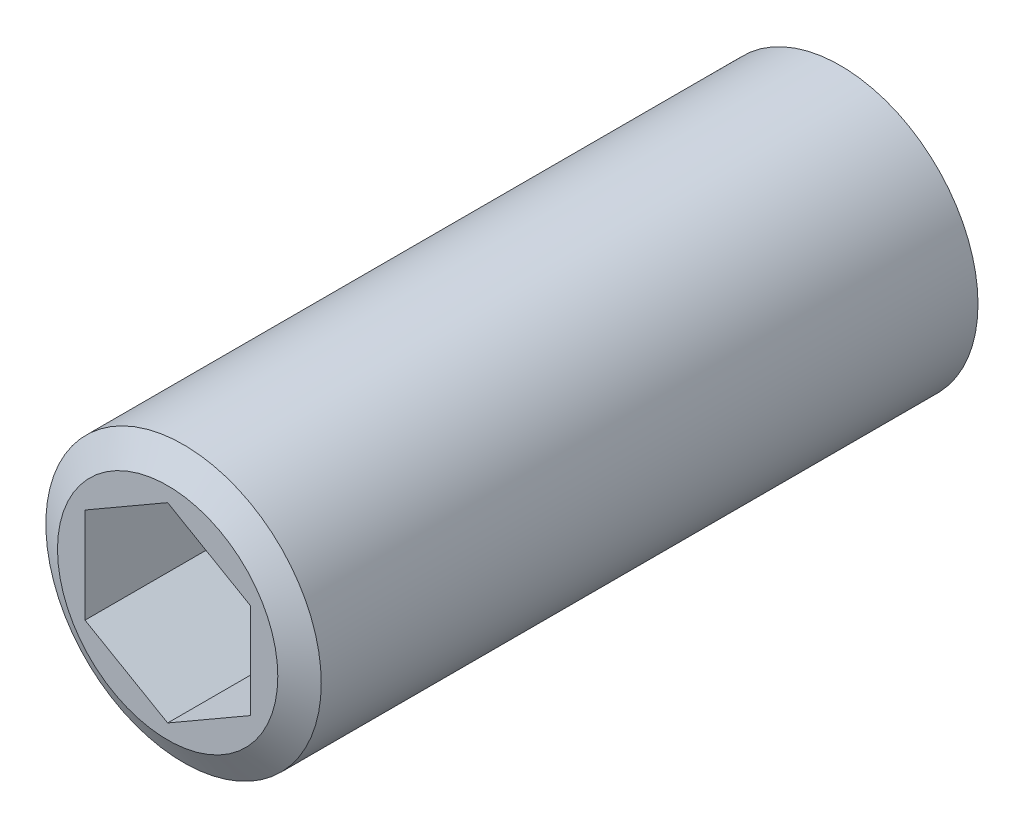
ISO-10303-21;
HEADER;
FILE_DESCRIPTION(('STEP AP214'),'2;1');
FILE_NAME('part.step','',(''),(''),'','','');
FILE_SCHEMA(('AUTOMOTIVE_DESIGN { 1 0 10303 214 1 1 1 1 }'));
ENDSEC;
DATA;
#1=APPLICATION_CONTEXT('core data for automotive mechanical design processes');
#2=APPLICATION_PROTOCOL_DEFINITION('international standard','automotive_design',2000,#1);
#3=PRODUCT_CONTEXT('',#1,'mechanical');
#4=PRODUCT('Part','Part','',(#3));
#5=PRODUCT_RELATED_PRODUCT_CATEGORY('part','',(#4));
#6=PRODUCT_DEFINITION_FORMATION('','',#4);
#7=PRODUCT_DEFINITION_CONTEXT('part definition',#1,'design');
#8=PRODUCT_DEFINITION('design','',#6,#7);
#9=PRODUCT_DEFINITION_SHAPE('','',#8);
#10=(LENGTH_UNIT() NAMED_UNIT(*) SI_UNIT(.MILLI.,.METRE.));
#11=(NAMED_UNIT(*) PLANE_ANGLE_UNIT() SI_UNIT($,.RADIAN.));
#12=(NAMED_UNIT(*) SI_UNIT($,.STERADIAN.) SOLID_ANGLE_UNIT());
#13=UNCERTAINTY_MEASURE_WITH_UNIT(LENGTH_MEASURE(1.E-05),#10,'distance_accuracy_value','');
#14=(GEOMETRIC_REPRESENTATION_CONTEXT(3) GLOBAL_UNCERTAINTY_ASSIGNED_CONTEXT((#13)) GLOBAL_UNIT_ASSIGNED_CONTEXT((#10,
#11,#12)) REPRESENTATION_CONTEXT('',''));
#15=CARTESIAN_POINT('',(0.,0.,0.));
#16=DIRECTION('',(0.,0.,1.));
#17=DIRECTION('',(1.,0.,0.));
#18=AXIS2_PLACEMENT_3D('',#15,#16,#17);
#19=CARTESIAN_POINT('',(5.,0.,1.27));
#20=DIRECTION('',(0.,0.,-1.));
#21=DIRECTION('',(-1.,0.,0.));
#22=AXIS2_PLACEMENT_3D('',#19,#20,#21);
#23=PLANE('',#22);
#24=CARTESIAN_POINT('',(0.,0.,1.27));
#25=DIRECTION('',(0.,0.,-1.));
#26=DIRECTION('',(-1.,0.,0.));
#27=AXIS2_PLACEMENT_3D('',#24,#25,#26);
#28=CIRCLE('',#27,4.);
#29=CARTESIAN_POINT('',(-4.,0.,1.27));
#30=VERTEX_POINT('',#29);
#31=EDGE_CURVE('E9',#30,#30,#28,.T.);
#32=ORIENTED_EDGE('',*,*,#31,.T.);
#33=EDGE_LOOP('',(#32));
#34=FACE_BOUND('',#33,.T.);
#35=CARTESIAN_POINT('',(0.,0.,1.27));
#36=DIRECTION('',(0.,0.,-1.));
#37=DIRECTION('',(-1.,0.,0.));
#38=AXIS2_PLACEMENT_3D('',#35,#36,#37);
#39=CIRCLE('',#38,3.95);
#40=CARTESIAN_POINT('',(-3.95,0.,1.27));
#41=VERTEX_POINT('',#40);
#42=EDGE_CURVE('E686',#41,#41,#39,.T.);
#43=ORIENTED_EDGE('',*,*,#42,.F.);
#44=EDGE_LOOP('',(#43));
#45=FACE_BOUND('',#44,.T.);
#46=ADVANCED_FACE('F15',(#34,#45),#23,.T.);
#47=CARTESIAN_POINT('',(0.,0.,46.27));
#48=DIRECTION('',(0.,0.,1.));
#49=DIRECTION('',(1.,0.,0.));
#50=AXIS2_PLACEMENT_3D('',#47,#48,#49);
#51=CYLINDRICAL_SURFACE('',#50,5.);
#52=CARTESIAN_POINT('',(0.,0.,25.6926497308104));
#53=DIRECTION('',(0.,0.,1.));
#54=DIRECTION('',(1.,0.,0.));
#55=AXIS2_PLACEMENT_3D('',#52,#53,#54);
#56=CIRCLE('',#55,5.);
#57=CARTESIAN_POINT('',(5.,0.,25.6926497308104));
#58=VERTEX_POINT('',#57);
#59=EDGE_CURVE('E24',#58,#58,#56,.F.);
#60=ORIENTED_EDGE('',*,*,#59,.T.);
#61=EDGE_LOOP('',(#60));
#62=FACE_BOUND('',#61,.T.);
#63=CARTESIAN_POINT('',(0.,0.,1.8473502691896));
#64=DIRECTION('',(0.,0.,-1.));
#65=DIRECTION('',(-1.,0.,0.));
#66=AXIS2_PLACEMENT_3D('',#63,#64,#65);
#67=CIRCLE('',#66,5.);
#68=CARTESIAN_POINT('',(-5.,0.,1.8473502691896));
#69=VERTEX_POINT('',#68);
#70=EDGE_CURVE('E168',#69,#69,#67,.F.);
#71=ORIENTED_EDGE('',*,*,#70,.T.);
#72=EDGE_LOOP('',(#71));
#73=FACE_BOUND('',#72,.T.);
#74=ADVANCED_FACE('F180',(#62,#73),#51,.T.);
#75=CARTESIAN_POINT('',(0.,0.,26.27));
#76=DIRECTION('',(0.,0.,1.));
#77=DIRECTION('',(1.,0.,0.));
#78=AXIS2_PLACEMENT_3D('',#75,#76,#77);
#79=PLANE('',#78);
#80=CARTESIAN_POINT('',(0.,0.,26.27));
#81=DIRECTION('',(0.,0.,1.));
#82=DIRECTION('',(1.,0.,0.));
#83=AXIS2_PLACEMENT_3D('',#80,#81,#82);
#84=CIRCLE('',#83,4.);
#85=CARTESIAN_POINT('',(4.,0.,26.27));
#86=VERTEX_POINT('',#85);
#87=EDGE_CURVE('E161',#86,#86,#84,.T.);
#88=ORIENTED_EDGE('',*,*,#87,.T.);
#89=EDGE_LOOP('',(#88));
#90=FACE_BOUND('',#89,.T.);
#91=DIRECTION('',(0.86602540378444,-0.5,0.));
#92=VECTOR('',#91,1.);
#93=CARTESIAN_POINT('',(-3.,-1.73205080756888,26.27));
#94=LINE('',#93,#92);
#95=CARTESIAN_POINT('',(-3.,-1.73205080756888,26.27));
#96=VERTEX_POINT('',#95);
#97=CARTESIAN_POINT('',(0.,-3.46410161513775,26.27));
#98=VERTEX_POINT('',#97);
#99=EDGE_CURVE('E197',#96,#98,#94,.T.);
#100=ORIENTED_EDGE('',*,*,#99,.F.);
#101=DIRECTION('',(0.,-1.,0.));
#102=VECTOR('',#101,1.);
#103=CARTESIAN_POINT('',(-3.,1.73205080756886,26.27));
#104=LINE('',#103,#102);
#105=CARTESIAN_POINT('',(-3.,1.73205080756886,26.27));
#106=VERTEX_POINT('',#105);
#107=EDGE_CURVE('E200',#106,#96,#104,.T.);
#108=ORIENTED_EDGE('',*,*,#107,.F.);
#109=DIRECTION('',(0.866025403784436,0.5,0.));
#110=VECTOR('',#109,1.);
#111=CARTESIAN_POINT('',(-3.,1.73205080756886,26.27));
#112=LINE('',#111,#110);
#113=CARTESIAN_POINT('',(0.,3.46410161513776,26.27));
#114=VERTEX_POINT('',#113);
#115=EDGE_CURVE('E226',#106,#114,#112,.T.);
#116=ORIENTED_EDGE('',*,*,#115,.T.);
#117=DIRECTION('',(-0.866025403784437,0.5,0.));
#118=VECTOR('',#117,1.);
#119=CARTESIAN_POINT('',(3.,1.73205080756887,26.27));
#120=LINE('',#119,#118);
#121=CARTESIAN_POINT('',(3.,1.73205080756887,26.27));
#122=VERTEX_POINT('',#121);
#123=EDGE_CURVE('E222',#122,#114,#120,.T.);
#124=ORIENTED_EDGE('',*,*,#123,.F.);
#125=DIRECTION('',(0.,-1.,0.));
#126=VECTOR('',#125,1.);
#127=CARTESIAN_POINT('',(3.,1.73205080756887,26.27));
#128=LINE('',#127,#126);
#129=CARTESIAN_POINT('',(3.,-1.73205080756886,26.27));
#130=VERTEX_POINT('',#129);
#131=EDGE_CURVE('E211',#122,#130,#128,.T.);
#132=ORIENTED_EDGE('',*,*,#131,.T.);
#133=DIRECTION('',(-0.866025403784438,-0.5,0.));
#134=VECTOR('',#133,1.);
#135=CARTESIAN_POINT('',(3.,-1.73205080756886,26.27));
#136=LINE('',#135,#134);
#137=EDGE_CURVE('E203',#130,#98,#136,.T.);
#138=ORIENTED_EDGE('',*,*,#137,.T.);
#139=EDGE_LOOP('',(#100,#108,#116,#124,#132,#138));
#140=FACE_BOUND('',#139,.T.);
#141=ADVANCED_FACE('F189',(#90,#140),#79,.T.);
#142=CARTESIAN_POINT('',(-3.,-1.73205080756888,21.27));
#143=DIRECTION('',(-0.5,-0.86602540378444,0.));
#144=DIRECTION('',(-0.86602540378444,0.5,0.));
#145=AXIS2_PLACEMENT_3D('',#142,#143,#144);
#146=PLANE('',#145);
#147=DIRECTION('',(0.,0.,1.));
#148=VECTOR('',#147,1.);
#149=CARTESIAN_POINT('',(-3.,-1.73205080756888,21.27));
#150=LINE('',#149,#148);
#151=CARTESIAN_POINT('',(-3.,-1.73205080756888,21.27));
#152=VERTEX_POINT('',#151);
#153=EDGE_CURVE('E162',#152,#96,#150,.T.);
#154=ORIENTED_EDGE('',*,*,#153,.T.);
#155=ORIENTED_EDGE('',*,*,#99,.T.);
#156=DIRECTION('',(0.,0.,1.));
#157=VECTOR('',#156,1.);
#158=CARTESIAN_POINT('',(0.,-3.46410161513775,21.27));
#159=LINE('',#158,#157);
#160=CARTESIAN_POINT('',(0.,-3.46410161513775,21.27));
#161=VERTEX_POINT('',#160);
#162=EDGE_CURVE('E255',#161,#98,#159,.T.);
#163=ORIENTED_EDGE('',*,*,#162,.F.);
#164=DIRECTION('',(0.86602540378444,-0.5,0.));
#165=VECTOR('',#164,1.);
#166=CARTESIAN_POINT('',(-3.,-1.73205080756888,21.27));
#167=LINE('',#166,#165);
#168=EDGE_CURVE('E231',#152,#161,#167,.T.);
#169=ORIENTED_EDGE('',*,*,#168,.F.);
#170=EDGE_LOOP('',(#154,#155,#163,#169));
#171=FACE_BOUND('',#170,.T.);
#172=ADVANCED_FACE('F192',(#171),#146,.F.);
#173=CARTESIAN_POINT('',(-3.,1.73205080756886,21.27));
#174=DIRECTION('',(-1.,0.,0.));
#175=DIRECTION('',(0.,1.,0.));
#176=AXIS2_PLACEMENT_3D('',#173,#174,#175);
#177=PLANE('',#176);
#178=DIRECTION('',(0.,0.,1.));
#179=VECTOR('',#178,1.);
#180=CARTESIAN_POINT('',(-3.,1.73205080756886,21.27));
#181=LINE('',#180,#179);
#182=CARTESIAN_POINT('',(-3.,1.73205080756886,21.27));
#183=VERTEX_POINT('',#182);
#184=EDGE_CURVE('E170',#183,#106,#181,.T.);
#185=ORIENTED_EDGE('',*,*,#184,.T.);
#186=ORIENTED_EDGE('',*,*,#107,.T.);
#187=ORIENTED_EDGE('',*,*,#153,.F.);
#188=DIRECTION('',(0.,-1.,0.));
#189=VECTOR('',#188,1.);
#190=CARTESIAN_POINT('',(-3.,1.73205080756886,21.27));
#191=LINE('',#190,#189);
#192=EDGE_CURVE('E251',#183,#152,#191,.T.);
#193=ORIENTED_EDGE('',*,*,#192,.F.);
#194=EDGE_LOOP('',(#185,#186,#187,#193));
#195=FACE_BOUND('',#194,.T.);
#196=ADVANCED_FACE('F270',(#195),#177,.F.);
#197=CARTESIAN_POINT('',(-3.,1.73205080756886,21.27));
#198=DIRECTION('',(0.5,-0.866025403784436,0.));
#199=DIRECTION('',(-0.866025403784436,-0.5,0.));
#200=AXIS2_PLACEMENT_3D('',#197,#198,#199);
#201=PLANE('',#200);
#202=DIRECTION('',(0.,0.,1.));
#203=VECTOR('',#202,1.);
#204=CARTESIAN_POINT('',(0.,3.46410161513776,21.27));
#205=LINE('',#204,#203);
#206=CARTESIAN_POINT('',(0.,3.46410161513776,21.27));
#207=VERTEX_POINT('',#206);
#208=EDGE_CURVE('E264',#207,#114,#205,.T.);
#209=ORIENTED_EDGE('',*,*,#208,.T.);
#210=ORIENTED_EDGE('',*,*,#115,.F.);
#211=ORIENTED_EDGE('',*,*,#184,.F.);
#212=DIRECTION('',(0.866025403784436,0.5,0.));
#213=VECTOR('',#212,1.);
#214=CARTESIAN_POINT('',(-3.,1.73205080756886,21.27));
#215=LINE('',#214,#213);
#216=EDGE_CURVE('E247',#183,#207,#215,.T.);
#217=ORIENTED_EDGE('',*,*,#216,.T.);
#218=EDGE_LOOP('',(#209,#210,#211,#217));
#219=FACE_BOUND('',#218,.T.);
#220=ADVANCED_FACE('F273',(#219),#201,.T.);
#221=CARTESIAN_POINT('',(3.,1.73205080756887,21.27));
#222=DIRECTION('',(0.5,0.866025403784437,0.));
#223=DIRECTION('',(0.866025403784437,-0.5,0.));
#224=AXIS2_PLACEMENT_3D('',#221,#222,#223);
#225=PLANE('',#224);
#226=DIRECTION('',(0.,0.,1.));
#227=VECTOR('',#226,1.);
#228=CARTESIAN_POINT('',(3.,1.73205080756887,21.27));
#229=LINE('',#228,#227);
#230=CARTESIAN_POINT('',(3.,1.73205080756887,21.27));
#231=VERTEX_POINT('',#230);
#232=EDGE_CURVE('E261',#231,#122,#229,.T.);
#233=ORIENTED_EDGE('',*,*,#232,.T.);
#234=ORIENTED_EDGE('',*,*,#123,.T.);
#235=ORIENTED_EDGE('',*,*,#208,.F.);
#236=DIRECTION('',(-0.866025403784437,0.5,0.));
#237=VECTOR('',#236,1.);
#238=CARTESIAN_POINT('',(3.,1.73205080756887,21.27));
#239=LINE('',#238,#237);
#240=EDGE_CURVE('E243',#231,#207,#239,.T.);
#241=ORIENTED_EDGE('',*,*,#240,.F.);
#242=EDGE_LOOP('',(#233,#234,#235,#241));
#243=FACE_BOUND('',#242,.T.);
#244=ADVANCED_FACE('F277',(#243),#225,.F.);
#245=CARTESIAN_POINT('',(3.,1.73205080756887,21.27));
#246=DIRECTION('',(-1.,0.,0.));
#247=DIRECTION('',(0.,1.,0.));
#248=AXIS2_PLACEMENT_3D('',#245,#246,#247);
#249=PLANE('',#248);
#250=DIRECTION('',(0.,0.,1.));
#251=VECTOR('',#250,1.);
#252=CARTESIAN_POINT('',(3.,-1.73205080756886,21.27));
#253=LINE('',#252,#251);
#254=CARTESIAN_POINT('',(3.,-1.73205080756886,21.27));
#255=VERTEX_POINT('',#254);
#256=EDGE_CURVE('E258',#255,#130,#253,.T.);
#257=ORIENTED_EDGE('',*,*,#256,.T.);
#258=ORIENTED_EDGE('',*,*,#131,.F.);
#259=ORIENTED_EDGE('',*,*,#232,.F.);
#260=DIRECTION('',(0.,-1.,0.));
#261=VECTOR('',#260,1.);
#262=CARTESIAN_POINT('',(3.,1.73205080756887,21.27));
#263=LINE('',#262,#261);
#264=EDGE_CURVE('E239',#231,#255,#263,.T.);
#265=ORIENTED_EDGE('',*,*,#264,.T.);
#266=EDGE_LOOP('',(#257,#258,#259,#265));
#267=FACE_BOUND('',#266,.T.);
#268=ADVANCED_FACE('F281',(#267),#249,.T.);
#269=CARTESIAN_POINT('',(3.,-1.73205080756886,21.27));
#270=DIRECTION('',(-0.5,0.866025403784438,0.));
#271=DIRECTION('',(0.866025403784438,0.5,0.));
#272=AXIS2_PLACEMENT_3D('',#269,#270,#271);
#273=PLANE('',#272);
#274=DIRECTION('',(-0.866025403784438,-0.5,0.));
#275=VECTOR('',#274,1.);
#276=CARTESIAN_POINT('',(3.,-1.73205080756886,21.27));
#277=LINE('',#276,#275);
#278=EDGE_CURVE('E235',#255,#161,#277,.T.);
#279=ORIENTED_EDGE('',*,*,#278,.T.);
#280=ORIENTED_EDGE('',*,*,#162,.T.);
#281=ORIENTED_EDGE('',*,*,#137,.F.);
#282=ORIENTED_EDGE('',*,*,#256,.F.);
#283=EDGE_LOOP('',(#279,#280,#281,#282));
#284=FACE_BOUND('',#283,.T.);
#285=ADVANCED_FACE('F284',(#284),#273,.T.);
#286=CARTESIAN_POINT('',(-6.,0.,21.27));
#287=DIRECTION('',(0.,0.,1.));
#288=DIRECTION('',(1.,0.,0.));
#289=AXIS2_PLACEMENT_3D('',#286,#287,#288);
#290=PLANE('',#289);
#291=ORIENTED_EDGE('',*,*,#168,.T.);
#292=ORIENTED_EDGE('',*,*,#278,.F.);
#293=ORIENTED_EDGE('',*,*,#264,.F.);
#294=ORIENTED_EDGE('',*,*,#240,.T.);
#295=ORIENTED_EDGE('',*,*,#216,.F.);
#296=ORIENTED_EDGE('',*,*,#192,.T.);
#297=EDGE_LOOP('',(#291,#292,#293,#294,#295,#296));
#298=FACE_BOUND('',#297,.T.);
#299=ADVANCED_FACE('F287',(#298),#290,.T.);
#300=CARTESIAN_POINT('',(0.,0.,9.17));
#301=DIRECTION('',(0.,0.,-1.));
#302=DIRECTION('',(-1.,0.,0.));
#303=AXIS2_PLACEMENT_3D('',#300,#301,#302);
#304=CYLINDRICAL_SURFACE('',#303,3.95);
#305=ORIENTED_EDGE('',*,*,#42,.T.);
#306=EDGE_LOOP('',(#305));
#307=FACE_BOUND('',#306,.T.);
#308=CARTESIAN_POINT('',(0.,0.,1.5));
#309=DIRECTION('',(0.,0.,1.));
#310=DIRECTION('',(1.,0.,0.));
#311=AXIS2_PLACEMENT_3D('',#308,#309,#310);
#312=CIRCLE('',#311,3.95);
#313=CARTESIAN_POINT('',(-2.56953303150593,-3.,1.5));
#314=VERTEX_POINT('',#313);
#315=CARTESIAN_POINT('',(2.56953303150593,-3.,1.5));
#316=VERTEX_POINT('',#315);
#317=EDGE_CURVE('E156',#314,#316,#312,.T.);
#318=ORIENTED_EDGE('',*,*,#317,.T.);
#319=CARTESIAN_POINT('',(0.,0.,-1.5));
#320=DIRECTION('',(0.,0.707106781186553,0.707106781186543));
#321=DIRECTION('',(0.,0.707106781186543,-0.707106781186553));
#322=AXIS2_PLACEMENT_3D('',#319,#320,#321);
#323=ELLIPSE('',#322,5.58614357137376,3.95);
#324=CARTESIAN_POINT('',(2.79307178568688,-2.79307178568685,1.29307178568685));
#325=VERTEX_POINT('',#324);
#326=EDGE_CURVE('E138',#316,#325,#323,.T.);
#327=ORIENTED_EDGE('',*,*,#326,.T.);
#328=CARTESIAN_POINT('',(0.,0.,-1.5));
#329=DIRECTION('',(-0.707106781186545,0.,0.70710678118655));
#330=DIRECTION('',(-0.70710678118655,0.,-0.707106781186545));
#331=AXIS2_PLACEMENT_3D('',#328,#329,#330);
#332=ELLIPSE('',#331,5.58614357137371,3.95);
#333=CARTESIAN_POINT('',(3.,-2.56953303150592,1.5));
#334=VERTEX_POINT('',#333);
#335=EDGE_CURVE('E150',#325,#334,#332,.T.);
#336=ORIENTED_EDGE('',*,*,#335,.T.);
#337=CARTESIAN_POINT('',(3.,2.56953303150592,1.5));
#338=VERTEX_POINT('',#337);
#339=EDGE_CURVE('E573',#334,#338,#312,.T.);
#340=ORIENTED_EDGE('',*,*,#339,.T.);
#341=CARTESIAN_POINT('',(0.,0.,-1.5));
#342=DIRECTION('',(-0.707106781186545,0.,0.70710678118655));
#343=DIRECTION('',(-0.70710678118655,0.,-0.707106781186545));
#344=AXIS2_PLACEMENT_3D('',#341,#342,#343);
#345=ELLIPSE('',#344,5.58614357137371,3.95);
#346=CARTESIAN_POINT('',(2.79307178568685,2.79307178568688,1.29307178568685));
#347=VERTEX_POINT('',#346);
#348=EDGE_CURVE('E564',#338,#347,#345,.T.);
#349=ORIENTED_EDGE('',*,*,#348,.T.);
#350=CARTESIAN_POINT('',(0.,0.,-1.5));
#351=DIRECTION('',(0.,-0.70710678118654,0.707106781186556));
#352=DIRECTION('',(0.,-0.707106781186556,-0.707106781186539));
#353=AXIS2_PLACEMENT_3D('',#350,#351,#352);
#354=ELLIPSE('',#353,5.58614357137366,3.95);
#355=CARTESIAN_POINT('',(2.56953303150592,3.,1.5));
#356=VERTEX_POINT('',#355);
#357=EDGE_CURVE('E571',#347,#356,#354,.T.);
#358=ORIENTED_EDGE('',*,*,#357,.T.);
#359=CARTESIAN_POINT('',(-2.56953303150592,3.,1.5));
#360=VERTEX_POINT('',#359);
#361=EDGE_CURVE('E649',#356,#360,#312,.T.);
#362=ORIENTED_EDGE('',*,*,#361,.T.);
#363=CARTESIAN_POINT('',(0.,0.,-1.5));
#364=DIRECTION('',(0.,-0.70710678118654,0.707106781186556));
#365=DIRECTION('',(0.,-0.707106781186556,-0.707106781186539));
#366=AXIS2_PLACEMENT_3D('',#363,#364,#365);
#367=ELLIPSE('',#366,5.58614357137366,3.95);
#368=CARTESIAN_POINT('',(-2.79307178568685,2.79307178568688,1.29307178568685));
#369=VERTEX_POINT('',#368);
#370=EDGE_CURVE('E654',#360,#369,#367,.T.);
#371=ORIENTED_EDGE('',*,*,#370,.T.);
#372=CARTESIAN_POINT('',(0.,0.,-1.5));
#373=DIRECTION('',(0.707106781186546,0.,0.70710678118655));
#374=DIRECTION('',(0.70710678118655,0.,-0.707106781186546));
#375=AXIS2_PLACEMENT_3D('',#372,#373,#374);
#376=ELLIPSE('',#375,5.58614357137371,3.95);
#377=CARTESIAN_POINT('',(-3.,2.56953303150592,1.5));
#378=VERTEX_POINT('',#377);
#379=EDGE_CURVE('E647',#369,#378,#376,.T.);
#380=ORIENTED_EDGE('',*,*,#379,.T.);
#381=CARTESIAN_POINT('',(-3.,-2.56953303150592,1.5));
#382=VERTEX_POINT('',#381);
#383=EDGE_CURVE('E38',#378,#382,#312,.T.);
#384=ORIENTED_EDGE('',*,*,#383,.T.);
#385=CARTESIAN_POINT('',(0.,0.,-1.5));
#386=DIRECTION('',(0.707106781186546,0.,0.70710678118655));
#387=DIRECTION('',(0.70710678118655,0.,-0.707106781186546));
#388=AXIS2_PLACEMENT_3D('',#385,#386,#387);
#389=ELLIPSE('',#388,5.58614357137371,3.95);
#390=CARTESIAN_POINT('',(-2.79307178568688,-2.79307178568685,1.29307178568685));
#391=VERTEX_POINT('',#390);
#392=EDGE_CURVE('E31',#382,#391,#389,.T.);
#393=ORIENTED_EDGE('',*,*,#392,.T.);
#394=CARTESIAN_POINT('',(0.,0.,-1.5));
#395=DIRECTION('',(0.,0.707106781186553,0.707106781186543));
#396=DIRECTION('',(0.,0.707106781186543,-0.707106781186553));
#397=AXIS2_PLACEMENT_3D('',#394,#395,#396);
#398=ELLIPSE('',#397,5.58614357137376,3.95);
#399=EDGE_CURVE('E155',#391,#314,#398,.T.);
#400=ORIENTED_EDGE('',*,*,#399,.T.);
#401=EDGE_LOOP('',(#318,#327,#336,#340,#349,#358,#362,#371,#380,#384,#393,#400));
#402=FACE_BOUND('',#401,.T.);
#403=ADVANCED_FACE('F158',(#307,#402),#304,.F.);
#404=CARTESIAN_POINT('',(3.95,1.5,0.));
#405=DIRECTION('',(0.,0.707106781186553,0.707106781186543));
#406=DIRECTION('',(0.,0.707106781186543,-0.707106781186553));
#407=AXIS2_PLACEMENT_3D('',#404,#405,#406);
#408=PLANE('',#407);
#409=DIRECTION('',(-1.,0.,0.));
#410=VECTOR('',#409,1.);
#411=CARTESIAN_POINT('',(3.95,0.,1.5));
#412=LINE('',#411,#410);
#413=CARTESIAN_POINT('',(3.,0.,1.5));
#414=VERTEX_POINT('',#413);
#415=CARTESIAN_POINT('',(0.,0.,1.5));
#416=VERTEX_POINT('',#415);
#417=EDGE_CURVE('E611',#414,#416,#412,.T.);
#418=ORIENTED_EDGE('',*,*,#417,.T.);
#419=DIRECTION('',(-0.577350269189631,-0.577350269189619,0.577350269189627));
#420=VECTOR('',#419,1.);
#421=CARTESIAN_POINT('',(-0.316666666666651,-0.316666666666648,1.81666666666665));
#422=LINE('',#421,#420);
#423=CARTESIAN_POINT('',(1.5,1.5,0.));
#424=VERTEX_POINT('',#423);
#425=EDGE_CURVE('E621',#424,#416,#422,.T.);
#426=ORIENTED_EDGE('',*,*,#425,.F.);
#427=DIRECTION('',(-0.577350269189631,0.577350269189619,-0.577350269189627));
#428=VECTOR('',#427,1.);
#429=CARTESIAN_POINT('',(3.31666666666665,-0.316666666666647,1.81666666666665));
#430=LINE('',#429,#428);
#431=EDGE_CURVE('E630',#414,#424,#430,.T.);
#432=ORIENTED_EDGE('',*,*,#431,.F.);
#433=EDGE_LOOP('',(#418,#426,#432));
#434=FACE_BOUND('',#433,.T.);
#435=ADVANCED_FACE('F295',(#434),#408,.F.);
#436=CARTESIAN_POINT('',(-3.,0.,1.5));
#437=VERTEX_POINT('',#436);
#438=EDGE_CURVE('E597',#416,#437,#412,.T.);
#439=ORIENTED_EDGE('',*,*,#438,.T.);
#440=DIRECTION('',(-0.577350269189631,-0.577350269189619,0.577350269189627));
#441=VECTOR('',#440,1.);
#442=CARTESIAN_POINT('',(-4.31666666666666,-1.31666666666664,2.81666666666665));
#443=LINE('',#442,#441);
#444=CARTESIAN_POINT('',(-1.5,1.49999999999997,0.));
#445=VERTEX_POINT('',#444);
#446=EDGE_CURVE('E605',#445,#437,#443,.T.);
#447=ORIENTED_EDGE('',*,*,#446,.F.);
#448=DIRECTION('',(-0.577350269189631,0.577350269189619,-0.577350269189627));
#449=VECTOR('',#448,1.);
#450=CARTESIAN_POINT('',(0.316666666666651,-0.316666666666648,1.81666666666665));
#451=LINE('',#450,#449);
#452=EDGE_CURVE('E608',#416,#445,#451,.T.);
#453=ORIENTED_EDGE('',*,*,#452,.F.);
#454=EDGE_LOOP('',(#439,#447,#453));
#455=FACE_BOUND('',#454,.T.);
#456=ADVANCED_FACE('F366',(#455),#408,.F.);
#457=CARTESIAN_POINT('',(3.95,-1.5,0.));
#458=DIRECTION('',(0.,-0.707106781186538,0.707106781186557));
#459=DIRECTION('',(0.,0.707106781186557,0.707106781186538));
#460=AXIS2_PLACEMENT_3D('',#457,#458,#459);
#461=PLANE('',#460);
#462=DIRECTION('',(0.577350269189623,-0.577350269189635,-0.57735026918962));
#463=VECTOR('',#462,1.);
#464=CARTESIAN_POINT('',(2.31666666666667,-2.31666666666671,-0.81666666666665));
#465=LINE('',#464,#463);
#466=CARTESIAN_POINT('',(1.49999999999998,-1.5,0.));
#467=VERTEX_POINT('',#466);
#468=EDGE_CURVE('E623',#416,#467,#465,.T.);
#469=ORIENTED_EDGE('',*,*,#468,.F.);
#470=ORIENTED_EDGE('',*,*,#417,.F.);
#471=DIRECTION('',(0.577350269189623,0.577350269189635,0.577350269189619));
#472=VECTOR('',#471,1.);
#473=CARTESIAN_POINT('',(0.683333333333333,-2.31666666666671,-0.81666666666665));
#474=LINE('',#473,#472);
#475=EDGE_CURVE('E617',#467,#414,#474,.T.);
#476=ORIENTED_EDGE('',*,*,#475,.F.);
#477=EDGE_LOOP('',(#469,#470,#476));
#478=FACE_BOUND('',#477,.T.);
#479=ADVANCED_FACE('F376',(#478),#461,.F.);
#480=DIRECTION('',(0.577350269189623,-0.577350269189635,-0.57735026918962));
#481=VECTOR('',#480,1.);
#482=CARTESIAN_POINT('',(-1.68333333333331,-1.31666666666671,0.183333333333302));
#483=LINE('',#482,#481);
#484=CARTESIAN_POINT('',(-1.5,-1.5,0.));
#485=VERTEX_POINT('',#484);
#486=EDGE_CURVE('E146',#437,#485,#483,.T.);
#487=ORIENTED_EDGE('',*,*,#486,.F.);
#488=ORIENTED_EDGE('',*,*,#438,.F.);
#489=DIRECTION('',(0.577350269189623,0.577350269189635,0.57735026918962));
#490=VECTOR('',#489,1.);
#491=CARTESIAN_POINT('',(-2.31666666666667,-2.31666666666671,-0.81666666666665));
#492=LINE('',#491,#490);
#493=EDGE_CURVE('E600',#485,#416,#492,.T.);
#494=ORIENTED_EDGE('',*,*,#493,.F.);
#495=EDGE_LOOP('',(#487,#488,#494));
#496=FACE_BOUND('',#495,.T.);
#497=ADVANCED_FACE('F385',(#496),#461,.F.);
#498=CARTESIAN_POINT('',(-1.5,-3.95,0.));
#499=DIRECTION('',(-0.707106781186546,0.,0.70710678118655));
#500=DIRECTION('',(0.70710678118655,0.,0.707106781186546));
#501=AXIS2_PLACEMENT_3D('',#498,#499,#500);
#502=PLANE('',#501);
#503=ORIENTED_EDGE('',*,*,#452,.T.);
#504=DIRECTION('',(0.577350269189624,0.577350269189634,0.57735026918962));
#505=VECTOR('',#504,1.);
#506=CARTESIAN_POINT('',(-3.31666666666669,-0.316666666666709,-1.8166666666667));
#507=LINE('',#506,#505);
#508=CARTESIAN_POINT('',(0.,3.,1.5));
#509=VERTEX_POINT('',#508);
#510=EDGE_CURVE('E583',#445,#509,#507,.T.);
#511=ORIENTED_EDGE('',*,*,#510,.T.);
#512=DIRECTION('',(0.,1.,0.));
#513=VECTOR('',#512,1.);
#514=CARTESIAN_POINT('',(0.,-3.95,1.5));
#515=LINE('',#514,#513);
#516=EDGE_CURVE('E214',#416,#509,#515,.T.);
#517=ORIENTED_EDGE('',*,*,#516,.F.);
#518=EDGE_LOOP('',(#503,#511,#517));
#519=FACE_BOUND('',#518,.T.);
#520=ADVANCED_FACE('F395',(#519),#502,.F.);
#521=CARTESIAN_POINT('',(1.5,-3.95,0.));
#522=DIRECTION('',(0.707106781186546,0.,0.70710678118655));
#523=DIRECTION('',(0.70710678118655,0.,-0.707106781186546));
#524=AXIS2_PLACEMENT_3D('',#521,#522,#523);
#525=PLANE('',#524);
#526=ORIENTED_EDGE('',*,*,#516,.T.);
#527=DIRECTION('',(0.577350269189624,-0.577350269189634,-0.57735026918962));
#528=VECTOR('',#527,1.);
#529=CARTESIAN_POINT('',(3.31666666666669,-0.316666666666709,-1.8166666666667));
#530=LINE('',#529,#528);
#531=EDGE_CURVE('E579',#509,#424,#530,.T.);
#532=ORIENTED_EDGE('',*,*,#531,.T.);
#533=ORIENTED_EDGE('',*,*,#425,.T.);
#534=EDGE_LOOP('',(#526,#532,#533));
#535=FACE_BOUND('',#534,.T.);
#536=ADVANCED_FACE('F404',(#535),#525,.F.);
#537=DIRECTION('',(-0.577350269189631,0.577350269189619,-0.577350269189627));
#538=VECTOR('',#537,1.);
#539=CARTESIAN_POINT('',(-0.683333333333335,-2.31666666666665,0.816666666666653));
#540=LINE('',#539,#538);
#541=CARTESIAN_POINT('',(0.,-3.,1.5));
#542=VERTEX_POINT('',#541);
#543=EDGE_CURVE('E669',#542,#485,#540,.T.);
#544=ORIENTED_EDGE('',*,*,#543,.T.);
#545=ORIENTED_EDGE('',*,*,#493,.T.);
#546=EDGE_CURVE('E207',#542,#416,#515,.T.);
#547=ORIENTED_EDGE('',*,*,#546,.F.);
#548=EDGE_LOOP('',(#544,#545,#547));
#549=FACE_BOUND('',#548,.T.);
#550=ADVANCED_FACE('F407',(#549),#502,.F.);
#551=ORIENTED_EDGE('',*,*,#546,.T.);
#552=ORIENTED_EDGE('',*,*,#468,.T.);
#553=DIRECTION('',(-0.577350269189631,-0.577350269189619,0.577350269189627));
#554=VECTOR('',#553,1.);
#555=CARTESIAN_POINT('',(0.683333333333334,-2.31666666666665,0.816666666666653));
#556=LINE('',#555,#554);
#557=EDGE_CURVE('E141',#467,#542,#556,.T.);
#558=ORIENTED_EDGE('',*,*,#557,.T.);
#559=EDGE_LOOP('',(#551,#552,#558));
#560=FACE_BOUND('',#559,.T.);
#561=ADVANCED_FACE('F417',(#560),#525,.F.);
#562=CARTESIAN_POINT('',(-3.95,-3.95,1.5));
#563=DIRECTION('',(0.,0.,1.));
#564=DIRECTION('',(1.,0.,0.));
#565=AXIS2_PLACEMENT_3D('',#562,#563,#564);
#566=PLANE('',#565);
#567=DIRECTION('',(0.,1.,0.));
#568=VECTOR('',#567,1.);
#569=CARTESIAN_POINT('',(3.,-3.95,1.5));
#570=LINE('',#569,#568);
#571=EDGE_CURVE('E217',#414,#338,#570,.T.);
#572=ORIENTED_EDGE('',*,*,#571,.T.);
#573=ORIENTED_EDGE('',*,*,#339,.F.);
#574=EDGE_CURVE('E152',#334,#414,#570,.T.);
#575=ORIENTED_EDGE('',*,*,#574,.T.);
#576=EDGE_LOOP('',(#572,#573,#575));
#577=FACE_BOUND('',#576,.T.);
#578=ADVANCED_FACE('F433',(#577),#566,.F.);
#579=CARTESIAN_POINT('',(3.95,-3.,1.5));
#580=DIRECTION('',(0.,0.707106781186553,0.707106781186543));
#581=DIRECTION('',(0.,0.707106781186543,-0.707106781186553));
#582=AXIS2_PLACEMENT_3D('',#579,#580,#581);
#583=PLANE('',#582);
#584=ORIENTED_EDGE('',*,*,#326,.F.);
#585=DIRECTION('',(-1.,0.,0.));
#586=VECTOR('',#585,1.);
#587=CARTESIAN_POINT('',(3.95,-3.,1.5));
#588=LINE('',#587,#586);
#589=EDGE_CURVE('E612',#316,#542,#588,.T.);
#590=ORIENTED_EDGE('',*,*,#589,.T.);
#591=ORIENTED_EDGE('',*,*,#557,.F.);
#592=DIRECTION('',(-0.577350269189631,0.577350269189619,-0.577350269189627));
#593=VECTOR('',#592,1.);
#594=CARTESIAN_POINT('',(2.31666666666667,-2.31666666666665,0.816666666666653));
#595=LINE('',#594,#593);
#596=EDGE_CURVE('E134',#325,#467,#595,.T.);
#597=ORIENTED_EDGE('',*,*,#596,.F.);
#598=EDGE_LOOP('',(#584,#590,#591,#597));
#599=FACE_BOUND('',#598,.T.);
#600=ADVANCED_FACE('F136',(#599),#583,.F.);
#601=ORIENTED_EDGE('',*,*,#399,.F.);
#602=DIRECTION('',(-0.577350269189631,-0.577350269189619,0.577350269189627));
#603=VECTOR('',#602,1.);
#604=CARTESIAN_POINT('',(-3.31666666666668,-3.31666666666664,1.81666666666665));
#605=LINE('',#604,#603);
#606=EDGE_CURVE('E666',#485,#391,#605,.T.);
#607=ORIENTED_EDGE('',*,*,#606,.F.);
#608=ORIENTED_EDGE('',*,*,#543,.F.);
#609=EDGE_CURVE('E658',#542,#314,#588,.T.);
#610=ORIENTED_EDGE('',*,*,#609,.T.);
#611=EDGE_LOOP('',(#601,#607,#608,#610));
#612=FACE_BOUND('',#611,.T.);
#613=ADVANCED_FACE('F453',(#612),#583,.F.);
#614=ORIENTED_EDGE('',*,*,#317,.F.);
#615=ORIENTED_EDGE('',*,*,#609,.F.);
#616=ORIENTED_EDGE('',*,*,#589,.F.);
#617=EDGE_LOOP('',(#614,#615,#616));
#618=FACE_BOUND('',#617,.T.);
#619=ADVANCED_FACE('F445',(#618),#566,.F.);
#620=ORIENTED_EDGE('',*,*,#383,.F.);
#621=DIRECTION('',(0.,1.,0.));
#622=VECTOR('',#621,1.);
#623=CARTESIAN_POINT('',(-3.,-3.95,1.5));
#624=LINE('',#623,#622);
#625=EDGE_CURVE('E578',#437,#378,#624,.T.);
#626=ORIENTED_EDGE('',*,*,#625,.F.);
#627=EDGE_CURVE('E588',#382,#437,#624,.T.);
#628=ORIENTED_EDGE('',*,*,#627,.F.);
#629=EDGE_LOOP('',(#620,#626,#628));
#630=FACE_BOUND('',#629,.T.);
#631=ADVANCED_FACE('F470',(#630),#566,.F.);
#632=CARTESIAN_POINT('',(-3.,-3.95,1.5));
#633=DIRECTION('',(0.707106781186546,0.,0.70710678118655));
#634=DIRECTION('',(0.70710678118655,0.,-0.707106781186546));
#635=AXIS2_PLACEMENT_3D('',#632,#633,#634);
#636=PLANE('',#635);
#637=ORIENTED_EDGE('',*,*,#392,.F.);
#638=ORIENTED_EDGE('',*,*,#627,.T.);
#639=ORIENTED_EDGE('',*,*,#486,.T.);
#640=ORIENTED_EDGE('',*,*,#606,.T.);
#641=EDGE_LOOP('',(#637,#638,#639,#640));
#642=FACE_BOUND('',#641,.T.);
#643=ADVANCED_FACE('F479',(#642),#636,.F.);
#644=CARTESIAN_POINT('',(1.5,-3.95,0.));
#645=DIRECTION('',(-0.707106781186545,0.,0.70710678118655));
#646=DIRECTION('',(0.70710678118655,0.,0.707106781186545));
#647=AXIS2_PLACEMENT_3D('',#644,#645,#646);
#648=PLANE('',#647);
#649=ORIENTED_EDGE('',*,*,#335,.F.);
#650=ORIENTED_EDGE('',*,*,#596,.T.);
#651=ORIENTED_EDGE('',*,*,#475,.T.);
#652=ORIENTED_EDGE('',*,*,#574,.F.);
#653=EDGE_LOOP('',(#649,#650,#651,#652));
#654=FACE_BOUND('',#653,.T.);
#655=ADVANCED_FACE('F151',(#654),#648,.F.);
#656=CARTESIAN_POINT('',(3.95,1.5,0.));
#657=DIRECTION('',(0.,-0.70710678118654,0.707106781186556));
#658=DIRECTION('',(0.,0.707106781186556,0.707106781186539));
#659=AXIS2_PLACEMENT_3D('',#656,#657,#658);
#660=PLANE('',#659);
#661=ORIENTED_EDGE('',*,*,#370,.F.);
#662=DIRECTION('',(-1.,0.,0.));
#663=VECTOR('',#662,1.);
#664=CARTESIAN_POINT('',(3.95,3.,1.5));
#665=LINE('',#664,#663);
#666=EDGE_CURVE('E662',#509,#360,#665,.T.);
#667=ORIENTED_EDGE('',*,*,#666,.F.);
#668=ORIENTED_EDGE('',*,*,#510,.F.);
#669=DIRECTION('',(0.577350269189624,-0.577350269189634,-0.57735026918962));
#670=VECTOR('',#669,1.);
#671=CARTESIAN_POINT('',(-0.683333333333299,0.683333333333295,-0.816666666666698));
#672=LINE('',#671,#670);
#673=EDGE_CURVE('E615',#369,#445,#672,.T.);
#674=ORIENTED_EDGE('',*,*,#673,.F.);
#675=EDGE_LOOP('',(#661,#667,#668,#674));
#676=FACE_BOUND('',#675,.T.);
#677=ADVANCED_FACE('F496',(#676),#660,.F.);
#678=ORIENTED_EDGE('',*,*,#357,.F.);
#679=DIRECTION('',(0.577350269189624,0.577350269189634,0.57735026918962));
#680=VECTOR('',#679,1.);
#681=CARTESIAN_POINT('',(-0.316666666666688,-0.316666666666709,-1.8166666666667));
#682=LINE('',#681,#680);
#683=EDGE_CURVE('E568',#424,#347,#682,.T.);
#684=ORIENTED_EDGE('',*,*,#683,.F.);
#685=ORIENTED_EDGE('',*,*,#531,.F.);
#686=EDGE_CURVE('E642',#356,#509,#665,.T.);
#687=ORIENTED_EDGE('',*,*,#686,.F.);
#688=EDGE_LOOP('',(#678,#684,#685,#687));
#689=FACE_BOUND('',#688,.T.);
#690=ADVANCED_FACE('F504',(#689),#660,.F.);
#691=ORIENTED_EDGE('',*,*,#361,.F.);
#692=ORIENTED_EDGE('',*,*,#686,.T.);
#693=ORIENTED_EDGE('',*,*,#666,.T.);
#694=EDGE_LOOP('',(#691,#692,#693));
#695=FACE_BOUND('',#694,.T.);
#696=ADVANCED_FACE('F444',(#695),#566,.F.);
#697=ORIENTED_EDGE('',*,*,#379,.F.);
#698=ORIENTED_EDGE('',*,*,#673,.T.);
#699=ORIENTED_EDGE('',*,*,#446,.T.);
#700=ORIENTED_EDGE('',*,*,#625,.T.);
#701=EDGE_LOOP('',(#697,#698,#699,#700));
#702=FACE_BOUND('',#701,.T.);
#703=ADVANCED_FACE('F488',(#702),#636,.F.);
#704=ORIENTED_EDGE('',*,*,#348,.F.);
#705=ORIENTED_EDGE('',*,*,#571,.F.);
#706=ORIENTED_EDGE('',*,*,#431,.T.);
#707=ORIENTED_EDGE('',*,*,#683,.T.);
#708=EDGE_LOOP('',(#704,#705,#706,#707));
#709=FACE_BOUND('',#708,.T.);
#710=ADVANCED_FACE('F186',(#709),#648,.F.);
#711=CARTESIAN_POINT('',(0.,0.,26.27));
#712=DIRECTION('',(0.,0.,-1.));
#713=DIRECTION('',(-1.,0.,0.));
#714=AXIS2_PLACEMENT_3D('',#711,#712,#713);
#715=CONICAL_SURFACE('',#714,4.,1.0471975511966);
#716=ORIENTED_EDGE('',*,*,#59,.F.);
#717=EDGE_LOOP('',(#716));
#718=FACE_BOUND('',#717,.T.);
#719=ORIENTED_EDGE('',*,*,#87,.F.);
#720=EDGE_LOOP('',(#719));
#721=FACE_BOUND('',#720,.T.);
#722=ADVANCED_FACE('F183',(#718,#721),#715,.T.);
#723=CARTESIAN_POINT('',(0.,0.,1.8473502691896));
#724=DIRECTION('',(0.,0.,1.));
#725=DIRECTION('',(1.,0.,0.));
#726=AXIS2_PLACEMENT_3D('',#723,#724,#725);
#727=CONICAL_SURFACE('',#726,5.,1.04719755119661);
#728=ORIENTED_EDGE('',*,*,#31,.F.);
#729=EDGE_LOOP('',(#728));
#730=FACE_BOUND('',#729,.T.);
#731=ORIENTED_EDGE('',*,*,#70,.F.);
#732=EDGE_LOOP('',(#731));
#733=FACE_BOUND('',#732,.T.);
#734=ADVANCED_FACE('F17',(#730,#733),#727,.T.);
#735=CLOSED_SHELL('',(#46,#74,#141,#172,#196,#220,#244,#268,#285,#299,#403,#435,#456,#479,#497,
#520,#536,#550,#561,#578,#600,#613,#619,#631,#643,#655,#677,#690,#696,#703,#710,#722,#734));
#736=MANIFOLD_SOLID_BREP('B1',#735);
#737=ADVANCED_BREP_SHAPE_REPRESENTATION('',(#18,#736),#14);
#738=SHAPE_DEFINITION_REPRESENTATION(#9,#737);
ENDSEC;
END-ISO-10303-21;
